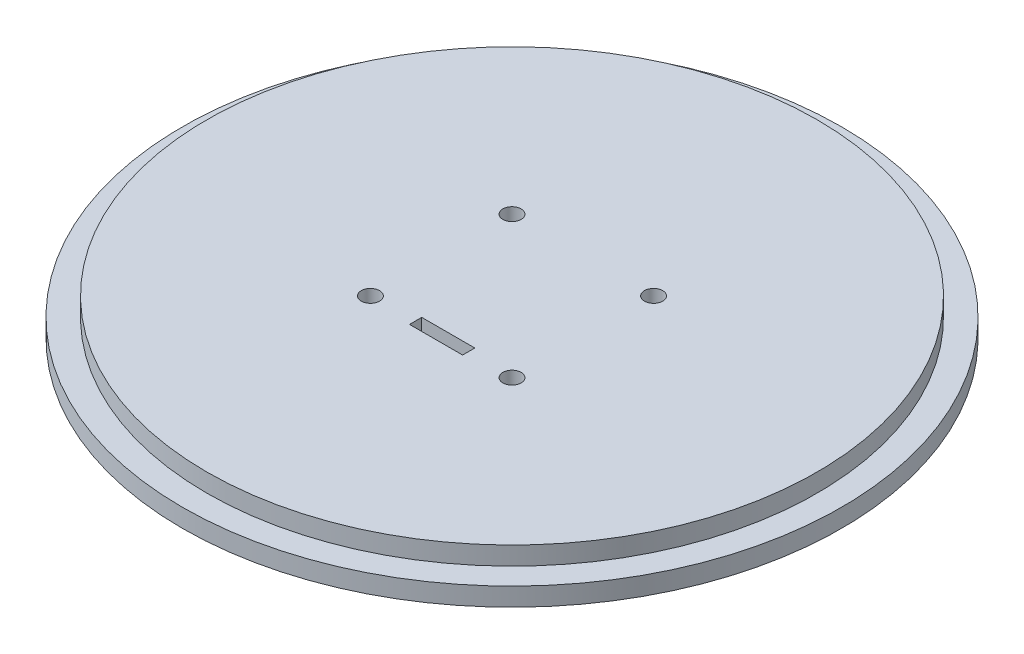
ISO-10303-21;
HEADER;
FILE_DESCRIPTION(('STEP AP214'),'2;1');
FILE_NAME('part.step','',(''),(''),'','','');
FILE_SCHEMA(('AUTOMOTIVE_DESIGN { 1 0 10303 214 1 1 1 1 }'));
ENDSEC;
DATA;
#1=APPLICATION_CONTEXT('core data for automotive mechanical design processes');
#2=APPLICATION_PROTOCOL_DEFINITION('international standard','automotive_design',2000,#1);
#3=PRODUCT_CONTEXT('',#1,'mechanical');
#4=PRODUCT('Part','Part','',(#3));
#5=PRODUCT_RELATED_PRODUCT_CATEGORY('part','',(#4));
#6=PRODUCT_DEFINITION_FORMATION('','',#4);
#7=PRODUCT_DEFINITION_CONTEXT('part definition',#1,'design');
#8=PRODUCT_DEFINITION('design','',#6,#7);
#9=PRODUCT_DEFINITION_SHAPE('','',#8);
#10=(LENGTH_UNIT() NAMED_UNIT(*) SI_UNIT(.MILLI.,.METRE.));
#11=(NAMED_UNIT(*) PLANE_ANGLE_UNIT() SI_UNIT($,.RADIAN.));
#12=(NAMED_UNIT(*) SI_UNIT($,.STERADIAN.) SOLID_ANGLE_UNIT());
#13=UNCERTAINTY_MEASURE_WITH_UNIT(LENGTH_MEASURE(1.E-05),#10,'distance_accuracy_value','');
#14=(GEOMETRIC_REPRESENTATION_CONTEXT(3) GLOBAL_UNCERTAINTY_ASSIGNED_CONTEXT((#13)) GLOBAL_UNIT_ASSIGNED_CONTEXT((#10,
#11,#12)) REPRESENTATION_CONTEXT('',''));
#15=CARTESIAN_POINT('',(0.,0.,0.));
#16=DIRECTION('',(0.,0.,1.));
#17=DIRECTION('',(1.,0.,0.));
#18=AXIS2_PLACEMENT_3D('',#15,#16,#17);
#19=CARTESIAN_POINT('',(-11.6,6.,-11.6));
#20=DIRECTION('',(0.,-1.,0.));
#21=DIRECTION('',(0.,0.,-1.));
#22=AXIS2_PLACEMENT_3D('',#19,#20,#21);
#23=CYLINDRICAL_SURFACE('',#22,1.5);
#24=CARTESIAN_POINT('',(-11.6,6.,-11.6));
#25=DIRECTION('',(0.,-1.,0.));
#26=DIRECTION('',(0.,0.,-1.));
#27=AXIS2_PLACEMENT_3D('',#24,#25,#26);
#28=CIRCLE('',#27,1.5);
#29=CARTESIAN_POINT('',(-11.6,6.,-13.1));
#30=VERTEX_POINT('',#29);
#31=EDGE_CURVE('E143',#30,#30,#28,.T.);
#32=ORIENTED_EDGE('',*,*,#31,.F.);
#33=EDGE_LOOP('',(#32));
#34=FACE_BOUND('',#33,.T.);
#35=CARTESIAN_POINT('',(-11.6,3.,-11.6));
#36=DIRECTION('',(0.,-1.,0.));
#37=DIRECTION('',(0.,0.,-1.));
#38=AXIS2_PLACEMENT_3D('',#35,#36,#37);
#39=CIRCLE('',#38,1.5);
#40=CARTESIAN_POINT('',(-11.6,3.,-13.1));
#41=VERTEX_POINT('',#40);
#42=EDGE_CURVE('E238',#41,#41,#39,.T.);
#43=ORIENTED_EDGE('',*,*,#42,.T.);
#44=EDGE_LOOP('',(#43));
#45=FACE_BOUND('',#44,.T.);
#46=ADVANCED_FACE('F33',(#34,#45),#23,.F.);
#47=CARTESIAN_POINT('',(11.6,6.,-11.6));
#48=DIRECTION('',(0.,-1.,0.));
#49=DIRECTION('',(0.,0.,-1.));
#50=AXIS2_PLACEMENT_3D('',#47,#48,#49);
#51=CYLINDRICAL_SURFACE('',#50,1.5);
#52=CARTESIAN_POINT('',(11.6,6.,-11.6));
#53=DIRECTION('',(0.,-1.,0.));
#54=DIRECTION('',(0.,0.,-1.));
#55=AXIS2_PLACEMENT_3D('',#52,#53,#54);
#56=CIRCLE('',#55,1.5);
#57=CARTESIAN_POINT('',(11.6,6.,-13.1));
#58=VERTEX_POINT('',#57);
#59=EDGE_CURVE('E140',#58,#58,#56,.T.);
#60=ORIENTED_EDGE('',*,*,#59,.F.);
#61=EDGE_LOOP('',(#60));
#62=FACE_BOUND('',#61,.T.);
#63=CARTESIAN_POINT('',(11.6,3.,-11.6));
#64=DIRECTION('',(0.,-1.,0.));
#65=DIRECTION('',(0.,0.,-1.));
#66=AXIS2_PLACEMENT_3D('',#63,#64,#65);
#67=CIRCLE('',#66,1.5);
#68=CARTESIAN_POINT('',(11.6,3.,-13.1));
#69=VERTEX_POINT('',#68);
#70=EDGE_CURVE('E233',#69,#69,#67,.T.);
#71=ORIENTED_EDGE('',*,*,#70,.T.);
#72=EDGE_LOOP('',(#71));
#73=FACE_BOUND('',#72,.T.);
#74=ADVANCED_FACE('F170',(#62,#73),#51,.F.);
#75=CARTESIAN_POINT('',(11.6,6.,11.6));
#76=DIRECTION('',(0.,-1.,0.));
#77=DIRECTION('',(0.,0.,-1.));
#78=AXIS2_PLACEMENT_3D('',#75,#76,#77);
#79=CYLINDRICAL_SURFACE('',#78,1.5);
#80=CARTESIAN_POINT('',(11.6,6.,11.6));
#81=DIRECTION('',(0.,-1.,0.));
#82=DIRECTION('',(0.,0.,-1.));
#83=AXIS2_PLACEMENT_3D('',#80,#81,#82);
#84=CIRCLE('',#83,1.5);
#85=CARTESIAN_POINT('',(11.6,6.,10.1));
#86=VERTEX_POINT('',#85);
#87=EDGE_CURVE('E137',#86,#86,#84,.T.);
#88=ORIENTED_EDGE('',*,*,#87,.F.);
#89=EDGE_LOOP('',(#88));
#90=FACE_BOUND('',#89,.T.);
#91=CARTESIAN_POINT('',(11.6,3.,11.6));
#92=DIRECTION('',(0.,-1.,0.));
#93=DIRECTION('',(0.,0.,-1.));
#94=AXIS2_PLACEMENT_3D('',#91,#92,#93);
#95=CIRCLE('',#94,1.5);
#96=CARTESIAN_POINT('',(11.6,3.,10.1));
#97=VERTEX_POINT('',#96);
#98=EDGE_CURVE('E241',#97,#97,#95,.T.);
#99=ORIENTED_EDGE('',*,*,#98,.T.);
#100=EDGE_LOOP('',(#99));
#101=FACE_BOUND('',#100,.T.);
#102=ADVANCED_FACE('F176',(#90,#101),#79,.F.);
#103=CARTESIAN_POINT('',(-11.6,6.,11.6));
#104=DIRECTION('',(0.,-1.,0.));
#105=DIRECTION('',(0.,0.,-1.));
#106=AXIS2_PLACEMENT_3D('',#103,#104,#105);
#107=CYLINDRICAL_SURFACE('',#106,1.49999999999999);
#108=CARTESIAN_POINT('',(-11.6,6.,11.6));
#109=DIRECTION('',(0.,-1.,0.));
#110=DIRECTION('',(0.,0.,-1.));
#111=AXIS2_PLACEMENT_3D('',#108,#109,#110);
#112=CIRCLE('',#111,1.49999999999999);
#113=CARTESIAN_POINT('',(-11.6,6.,10.1));
#114=VERTEX_POINT('',#113);
#115=EDGE_CURVE('E134',#114,#114,#112,.T.);
#116=ORIENTED_EDGE('',*,*,#115,.F.);
#117=EDGE_LOOP('',(#116));
#118=FACE_BOUND('',#117,.T.);
#119=CARTESIAN_POINT('',(-11.6,3.,11.6));
#120=DIRECTION('',(0.,-1.,0.));
#121=DIRECTION('',(0.,0.,-1.));
#122=AXIS2_PLACEMENT_3D('',#119,#120,#121);
#123=CIRCLE('',#122,1.49999999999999);
#124=CARTESIAN_POINT('',(-11.6,3.,10.1));
#125=VERTEX_POINT('',#124);
#126=EDGE_CURVE('E212',#125,#125,#123,.T.);
#127=ORIENTED_EDGE('',*,*,#126,.T.);
#128=EDGE_LOOP('',(#127));
#129=FACE_BOUND('',#128,.T.);
#130=ADVANCED_FACE('F277',(#118,#129),#107,.F.);
#131=CARTESIAN_POINT('',(4.35,6.,10.4416150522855));
#132=DIRECTION('',(1.,0.,0.));
#133=DIRECTION('',(0.,0.,-1.));
#134=AXIS2_PLACEMENT_3D('',#131,#132,#133);
#135=PLANE('',#134);
#136=DIRECTION('',(0.,0.,1.));
#137=VECTOR('',#136,1.);
#138=CARTESIAN_POINT('',(4.35,3.,10.4416150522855));
#139=LINE('',#138,#137);
#140=CARTESIAN_POINT('',(4.35,3.,10.4416150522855));
#141=VERTEX_POINT('',#140);
#142=CARTESIAN_POINT('',(4.35,3.,12.4416150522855));
#143=VERTEX_POINT('',#142);
#144=EDGE_CURVE('E100',#141,#143,#139,.T.);
#145=ORIENTED_EDGE('',*,*,#144,.T.);
#146=DIRECTION('',(0.,-1.,0.));
#147=VECTOR('',#146,1.);
#148=CARTESIAN_POINT('',(4.35,6.,12.4416150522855));
#149=LINE('',#148,#147);
#150=CARTESIAN_POINT('',(4.35,6.,12.4416150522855));
#151=VERTEX_POINT('',#150);
#152=EDGE_CURVE('E119',#151,#143,#149,.T.);
#153=ORIENTED_EDGE('',*,*,#152,.F.);
#154=DIRECTION('',(0.,0.,1.));
#155=VECTOR('',#154,1.);
#156=CARTESIAN_POINT('',(4.35,6.,10.4416150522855));
#157=LINE('',#156,#155);
#158=CARTESIAN_POINT('',(4.35,6.,10.4416150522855));
#159=VERTEX_POINT('',#158);
#160=EDGE_CURVE('E131',#159,#151,#157,.T.);
#161=ORIENTED_EDGE('',*,*,#160,.F.);
#162=DIRECTION('',(0.,-1.,0.));
#163=VECTOR('',#162,1.);
#164=CARTESIAN_POINT('',(4.35,6.,10.4416150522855));
#165=LINE('',#164,#163);
#166=EDGE_CURVE('E117',#159,#141,#165,.T.);
#167=ORIENTED_EDGE('',*,*,#166,.T.);
#168=EDGE_LOOP('',(#145,#153,#161,#167));
#169=FACE_BOUND('',#168,.T.);
#170=ADVANCED_FACE('F231',(#169),#135,.F.);
#171=CARTESIAN_POINT('',(4.35,6.,10.4416150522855));
#172=DIRECTION('',(0.,0.,1.));
#173=DIRECTION('',(1.,0.,0.));
#174=AXIS2_PLACEMENT_3D('',#171,#172,#173);
#175=PLANE('',#174);
#176=DIRECTION('',(0.,-1.,0.));
#177=VECTOR('',#176,1.);
#178=CARTESIAN_POINT('',(-4.35,6.,10.4416150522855));
#179=LINE('',#178,#177);
#180=CARTESIAN_POINT('',(-4.35,6.,10.4416150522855));
#181=VERTEX_POINT('',#180);
#182=CARTESIAN_POINT('',(-4.35,3.,10.4416150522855));
#183=VERTEX_POINT('',#182);
#184=EDGE_CURVE('E110',#181,#183,#179,.T.);
#185=ORIENTED_EDGE('',*,*,#184,.T.);
#186=DIRECTION('',(1.,0.,0.));
#187=VECTOR('',#186,1.);
#188=CARTESIAN_POINT('',(4.35,3.,10.4416150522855));
#189=LINE('',#188,#187);
#190=EDGE_CURVE('E96',#183,#141,#189,.T.);
#191=ORIENTED_EDGE('',*,*,#190,.T.);
#192=ORIENTED_EDGE('',*,*,#166,.F.);
#193=DIRECTION('',(-1.,0.,0.));
#194=VECTOR('',#193,1.);
#195=CARTESIAN_POINT('',(4.35,6.,10.4416150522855));
#196=LINE('',#195,#194);
#197=EDGE_CURVE('E116',#159,#181,#196,.T.);
#198=ORIENTED_EDGE('',*,*,#197,.T.);
#199=EDGE_LOOP('',(#185,#191,#192,#198));
#200=FACE_BOUND('',#199,.T.);
#201=ADVANCED_FACE('F114',(#200),#175,.T.);
#202=CARTESIAN_POINT('',(-4.35,6.,10.4416150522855));
#203=DIRECTION('',(1.,0.,0.));
#204=DIRECTION('',(0.,0.,-1.));
#205=AXIS2_PLACEMENT_3D('',#202,#203,#204);
#206=PLANE('',#205);
#207=DIRECTION('',(0.,-1.,0.));
#208=VECTOR('',#207,1.);
#209=CARTESIAN_POINT('',(-4.35,6.,12.4416150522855));
#210=LINE('',#209,#208);
#211=CARTESIAN_POINT('',(-4.35,6.,12.4416150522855));
#212=VERTEX_POINT('',#211);
#213=CARTESIAN_POINT('',(-4.35,3.,12.4416150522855));
#214=VERTEX_POINT('',#213);
#215=EDGE_CURVE('E112',#212,#214,#210,.T.);
#216=ORIENTED_EDGE('',*,*,#215,.T.);
#217=DIRECTION('',(0.,0.,-1.));
#218=VECTOR('',#217,1.);
#219=CARTESIAN_POINT('',(-4.35,3.,10.4416150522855));
#220=LINE('',#219,#218);
#221=EDGE_CURVE('E56',#214,#183,#220,.T.);
#222=ORIENTED_EDGE('',*,*,#221,.T.);
#223=ORIENTED_EDGE('',*,*,#184,.F.);
#224=DIRECTION('',(0.,0.,1.));
#225=VECTOR('',#224,1.);
#226=CARTESIAN_POINT('',(-4.35,6.,10.4416150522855));
#227=LINE('',#226,#225);
#228=EDGE_CURVE('E126',#181,#212,#227,.T.);
#229=ORIENTED_EDGE('',*,*,#228,.T.);
#230=EDGE_LOOP('',(#216,#222,#223,#229));
#231=FACE_BOUND('',#230,.T.);
#232=ADVANCED_FACE('F108',(#231),#206,.T.);
#233=CARTESIAN_POINT('',(4.35,6.,12.4416150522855));
#234=DIRECTION('',(0.,0.,1.));
#235=DIRECTION('',(1.,0.,0.));
#236=AXIS2_PLACEMENT_3D('',#233,#234,#235);
#237=PLANE('',#236);
#238=DIRECTION('',(-1.,0.,0.));
#239=VECTOR('',#238,1.);
#240=CARTESIAN_POINT('',(4.35,3.,12.4416150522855));
#241=LINE('',#240,#239);
#242=EDGE_CURVE('E228',#143,#214,#241,.T.);
#243=ORIENTED_EDGE('',*,*,#242,.T.);
#244=ORIENTED_EDGE('',*,*,#215,.F.);
#245=DIRECTION('',(-1.,0.,0.));
#246=VECTOR('',#245,1.);
#247=CARTESIAN_POINT('',(4.35,6.,12.4416150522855));
#248=LINE('',#247,#246);
#249=EDGE_CURVE('E128',#151,#212,#248,.T.);
#250=ORIENTED_EDGE('',*,*,#249,.F.);
#251=ORIENTED_EDGE('',*,*,#152,.T.);
#252=EDGE_LOOP('',(#243,#244,#250,#251));
#253=FACE_BOUND('',#252,.T.);
#254=ADVANCED_FACE('F157',(#253),#237,.F.);
#255=CARTESIAN_POINT('',(0.,3.,0.));
#256=DIRECTION('',(0.,1.,0.));
#257=DIRECTION('',(0.,0.,1.));
#258=AXIS2_PLACEMENT_3D('',#255,#256,#257);
#259=PLANE('',#258);
#260=CARTESIAN_POINT('',(0.,3.,0.));
#261=DIRECTION('',(0.,1.,0.));
#262=DIRECTION('',(0.,0.,1.));
#263=AXIS2_PLACEMENT_3D('',#260,#261,#262);
#264=CIRCLE('',#263,54.);
#265=CARTESIAN_POINT('',(0.,3.,54.));
#266=VERTEX_POINT('',#265);
#267=EDGE_CURVE('E11',#266,#266,#264,.T.);
#268=ORIENTED_EDGE('',*,*,#267,.T.);
#269=EDGE_LOOP('',(#268));
#270=FACE_BOUND('',#269,.T.);
#271=CARTESIAN_POINT('',(0.,3.,0.));
#272=DIRECTION('',(0.,1.,0.));
#273=DIRECTION('',(0.,0.,1.));
#274=AXIS2_PLACEMENT_3D('',#271,#272,#273);
#275=CIRCLE('',#274,50.);
#276=CARTESIAN_POINT('',(0.,3.,50.));
#277=VERTEX_POINT('',#276);
#278=EDGE_CURVE('E146',#277,#277,#275,.T.);
#279=ORIENTED_EDGE('',*,*,#278,.F.);
#280=EDGE_LOOP('',(#279));
#281=FACE_BOUND('',#280,.T.);
#282=ADVANCED_FACE('F155',(#270,#281),#259,.T.);
#283=CARTESIAN_POINT('',(0.,3.,0.));
#284=DIRECTION('',(0.,-1.,0.));
#285=DIRECTION('',(0.,0.,-1.));
#286=AXIS2_PLACEMENT_3D('',#283,#284,#285);
#287=CYLINDRICAL_SURFACE('',#286,54.);
#288=ORIENTED_EDGE('',*,*,#267,.F.);
#289=EDGE_LOOP('',(#288));
#290=FACE_BOUND('',#289,.T.);
#291=CARTESIAN_POINT('',(0.,0.,0.));
#292=DIRECTION('',(0.,1.,0.));
#293=DIRECTION('',(0.,0.,1.));
#294=AXIS2_PLACEMENT_3D('',#291,#292,#293);
#295=CIRCLE('',#294,54.);
#296=CARTESIAN_POINT('',(0.,0.,54.));
#297=VERTEX_POINT('',#296);
#298=EDGE_CURVE('E37',#297,#297,#295,.T.);
#299=ORIENTED_EDGE('',*,*,#298,.T.);
#300=EDGE_LOOP('',(#299));
#301=FACE_BOUND('',#300,.T.);
#302=ADVANCED_FACE('F35',(#290,#301),#287,.T.);
#303=CARTESIAN_POINT('',(0.,0.,0.));
#304=DIRECTION('',(0.,1.,0.));
#305=DIRECTION('',(0.,0.,1.));
#306=AXIS2_PLACEMENT_3D('',#303,#304,#305);
#307=PLANE('',#306);
#308=DIRECTION('',(1.,0.,0.));
#309=VECTOR('',#308,1.);
#310=CARTESIAN_POINT('',(14.15,0.,-14.15));
#311=LINE('',#310,#309);
#312=CARTESIAN_POINT('',(-14.15,0.,-14.15));
#313=VERTEX_POINT('',#312);
#314=CARTESIAN_POINT('',(14.15,0.,-14.15));
#315=VERTEX_POINT('',#314);
#316=EDGE_CURVE('E201',#313,#315,#311,.T.);
#317=ORIENTED_EDGE('',*,*,#316,.F.);
#318=DIRECTION('',(0.,0.,-1.));
#319=VECTOR('',#318,1.);
#320=CARTESIAN_POINT('',(-14.15,0.,-14.15));
#321=LINE('',#320,#319);
#322=CARTESIAN_POINT('',(-14.15,0.,14.15));
#323=VERTEX_POINT('',#322);
#324=EDGE_CURVE('E48',#323,#313,#321,.T.);
#325=ORIENTED_EDGE('',*,*,#324,.F.);
#326=DIRECTION('',(-1.,0.,0.));
#327=VECTOR('',#326,1.);
#328=CARTESIAN_POINT('',(14.15,0.,14.15));
#329=LINE('',#328,#327);
#330=CARTESIAN_POINT('',(14.15,0.,14.15));
#331=VERTEX_POINT('',#330);
#332=EDGE_CURVE('E210',#331,#323,#329,.T.);
#333=ORIENTED_EDGE('',*,*,#332,.F.);
#334=DIRECTION('',(0.,0.,1.));
#335=VECTOR('',#334,1.);
#336=CARTESIAN_POINT('',(14.15,0.,-14.15));
#337=LINE('',#336,#335);
#338=EDGE_CURVE('E207',#315,#331,#337,.T.);
#339=ORIENTED_EDGE('',*,*,#338,.F.);
#340=EDGE_LOOP('',(#317,#325,#333,#339));
#341=FACE_BOUND('',#340,.T.);
#342=ORIENTED_EDGE('',*,*,#298,.F.);
#343=EDGE_LOOP('',(#342));
#344=FACE_BOUND('',#343,.T.);
#345=ADVANCED_FACE('F164',(#341,#344),#307,.F.);
#346=CARTESIAN_POINT('',(0.,6.,0.));
#347=DIRECTION('',(0.,-1.,0.));
#348=DIRECTION('',(0.,0.,-1.));
#349=AXIS2_PLACEMENT_3D('',#346,#347,#348);
#350=CYLINDRICAL_SURFACE('',#349,50.);
#351=CARTESIAN_POINT('',(0.,6.,0.));
#352=DIRECTION('',(0.,1.,0.));
#353=DIRECTION('',(0.,0.,1.));
#354=AXIS2_PLACEMENT_3D('',#351,#352,#353);
#355=CIRCLE('',#354,50.);
#356=CARTESIAN_POINT('',(0.,6.,50.));
#357=VERTEX_POINT('',#356);
#358=EDGE_CURVE('E147',#357,#357,#355,.T.);
#359=ORIENTED_EDGE('',*,*,#358,.F.);
#360=EDGE_LOOP('',(#359));
#361=FACE_BOUND('',#360,.T.);
#362=ORIENTED_EDGE('',*,*,#278,.T.);
#363=EDGE_LOOP('',(#362));
#364=FACE_BOUND('',#363,.T.);
#365=ADVANCED_FACE('F153',(#361,#364),#350,.T.);
#366=CARTESIAN_POINT('',(0.,6.,0.));
#367=DIRECTION('',(0.,1.,0.));
#368=DIRECTION('',(0.,0.,1.));
#369=AXIS2_PLACEMENT_3D('',#366,#367,#368);
#370=PLANE('',#369);
#371=ORIENTED_EDGE('',*,*,#160,.T.);
#372=ORIENTED_EDGE('',*,*,#249,.T.);
#373=ORIENTED_EDGE('',*,*,#228,.F.);
#374=ORIENTED_EDGE('',*,*,#197,.F.);
#375=EDGE_LOOP('',(#371,#372,#373,#374));
#376=FACE_BOUND('',#375,.T.);
#377=ORIENTED_EDGE('',*,*,#115,.T.);
#378=EDGE_LOOP('',(#377));
#379=FACE_BOUND('',#378,.T.);
#380=ORIENTED_EDGE('',*,*,#87,.T.);
#381=EDGE_LOOP('',(#380));
#382=FACE_BOUND('',#381,.T.);
#383=ORIENTED_EDGE('',*,*,#59,.T.);
#384=EDGE_LOOP('',(#383));
#385=FACE_BOUND('',#384,.T.);
#386=ORIENTED_EDGE('',*,*,#31,.T.);
#387=EDGE_LOOP('',(#386));
#388=FACE_BOUND('',#387,.T.);
#389=ORIENTED_EDGE('',*,*,#358,.T.);
#390=EDGE_LOOP('',(#389));
#391=FACE_BOUND('',#390,.T.);
#392=ADVANCED_FACE('F183',(#376,#379,#382,#385,#388,#391),#370,.T.);
#393=CARTESIAN_POINT('',(-14.15,3.,-14.15));
#394=DIRECTION('',(-1.,0.,0.));
#395=DIRECTION('',(0.,0.,1.));
#396=AXIS2_PLACEMENT_3D('',#393,#394,#395);
#397=PLANE('',#396);
#398=ORIENTED_EDGE('',*,*,#324,.T.);
#399=DIRECTION('',(0.,-1.,0.));
#400=VECTOR('',#399,1.);
#401=CARTESIAN_POINT('',(-14.15,3.,-14.15));
#402=LINE('',#401,#400);
#403=CARTESIAN_POINT('',(-14.15,3.,-14.15));
#404=VERTEX_POINT('',#403);
#405=EDGE_CURVE('E224',#404,#313,#402,.T.);
#406=ORIENTED_EDGE('',*,*,#405,.F.);
#407=DIRECTION('',(0.,0.,-1.));
#408=VECTOR('',#407,1.);
#409=CARTESIAN_POINT('',(-14.15,3.,-14.15));
#410=LINE('',#409,#408);
#411=CARTESIAN_POINT('',(-14.15,3.,14.15));
#412=VERTEX_POINT('',#411);
#413=EDGE_CURVE('E218',#412,#404,#410,.T.);
#414=ORIENTED_EDGE('',*,*,#413,.F.);
#415=DIRECTION('',(0.,-1.,0.));
#416=VECTOR('',#415,1.);
#417=CARTESIAN_POINT('',(-14.15,3.,14.15));
#418=LINE('',#417,#416);
#419=EDGE_CURVE('E121',#412,#323,#418,.T.);
#420=ORIENTED_EDGE('',*,*,#419,.T.);
#421=EDGE_LOOP('',(#398,#406,#414,#420));
#422=FACE_BOUND('',#421,.T.);
#423=ADVANCED_FACE('F185',(#422),#397,.F.);
#424=CARTESIAN_POINT('',(14.15,3.,14.15));
#425=DIRECTION('',(0.,0.,1.));
#426=DIRECTION('',(1.,0.,0.));
#427=AXIS2_PLACEMENT_3D('',#424,#425,#426);
#428=PLANE('',#427);
#429=ORIENTED_EDGE('',*,*,#332,.T.);
#430=ORIENTED_EDGE('',*,*,#419,.F.);
#431=DIRECTION('',(-1.,0.,0.));
#432=VECTOR('',#431,1.);
#433=CARTESIAN_POINT('',(14.15,3.,14.15));
#434=LINE('',#433,#432);
#435=CARTESIAN_POINT('',(14.15,3.,14.15));
#436=VERTEX_POINT('',#435);
#437=EDGE_CURVE('E225',#436,#412,#434,.T.);
#438=ORIENTED_EDGE('',*,*,#437,.F.);
#439=DIRECTION('',(0.,-1.,0.));
#440=VECTOR('',#439,1.);
#441=CARTESIAN_POINT('',(14.15,3.,14.15));
#442=LINE('',#441,#440);
#443=EDGE_CURVE('E220',#436,#331,#442,.T.);
#444=ORIENTED_EDGE('',*,*,#443,.T.);
#445=EDGE_LOOP('',(#429,#430,#438,#444));
#446=FACE_BOUND('',#445,.T.);
#447=ADVANCED_FACE('F259',(#446),#428,.F.);
#448=CARTESIAN_POINT('',(14.15,3.,-14.15));
#449=DIRECTION('',(1.,0.,0.));
#450=DIRECTION('',(0.,0.,-1.));
#451=AXIS2_PLACEMENT_3D('',#448,#449,#450);
#452=PLANE('',#451);
#453=ORIENTED_EDGE('',*,*,#338,.T.);
#454=ORIENTED_EDGE('',*,*,#443,.F.);
#455=DIRECTION('',(0.,0.,1.));
#456=VECTOR('',#455,1.);
#457=CARTESIAN_POINT('',(14.15,3.,-14.15));
#458=LINE('',#457,#456);
#459=CARTESIAN_POINT('',(14.15,3.,-14.15));
#460=VERTEX_POINT('',#459);
#461=EDGE_CURVE('E251',#460,#436,#458,.T.);
#462=ORIENTED_EDGE('',*,*,#461,.F.);
#463=DIRECTION('',(0.,-1.,0.));
#464=VECTOR('',#463,1.);
#465=CARTESIAN_POINT('',(14.15,3.,-14.15));
#466=LINE('',#465,#464);
#467=EDGE_CURVE('E222',#460,#315,#466,.T.);
#468=ORIENTED_EDGE('',*,*,#467,.T.);
#469=EDGE_LOOP('',(#453,#454,#462,#468));
#470=FACE_BOUND('',#469,.T.);
#471=ADVANCED_FACE('F263',(#470),#452,.F.);
#472=CARTESIAN_POINT('',(14.15,3.,-14.15));
#473=DIRECTION('',(0.,0.,-1.));
#474=DIRECTION('',(-1.,0.,0.));
#475=AXIS2_PLACEMENT_3D('',#472,#473,#474);
#476=PLANE('',#475);
#477=ORIENTED_EDGE('',*,*,#316,.T.);
#478=ORIENTED_EDGE('',*,*,#467,.F.);
#479=DIRECTION('',(1.,0.,0.));
#480=VECTOR('',#479,1.);
#481=CARTESIAN_POINT('',(14.15,3.,-14.15));
#482=LINE('',#481,#480);
#483=EDGE_CURVE('E248',#404,#460,#482,.T.);
#484=ORIENTED_EDGE('',*,*,#483,.F.);
#485=ORIENTED_EDGE('',*,*,#405,.T.);
#486=EDGE_LOOP('',(#477,#478,#484,#485));
#487=FACE_BOUND('',#486,.T.);
#488=ADVANCED_FACE('F261',(#487),#476,.F.);
#489=CARTESIAN_POINT('',(0.,3.,0.));
#490=DIRECTION('',(0.,-1.,0.));
#491=DIRECTION('',(0.,0.,-1.));
#492=AXIS2_PLACEMENT_3D('',#489,#490,#491);
#493=PLANE('',#492);
#494=ORIENTED_EDGE('',*,*,#242,.F.);
#495=ORIENTED_EDGE('',*,*,#144,.F.);
#496=ORIENTED_EDGE('',*,*,#190,.F.);
#497=ORIENTED_EDGE('',*,*,#221,.F.);
#498=EDGE_LOOP('',(#494,#495,#496,#497));
#499=FACE_BOUND('',#498,.T.);
#500=ORIENTED_EDGE('',*,*,#70,.F.);
#501=EDGE_LOOP('',(#500));
#502=FACE_BOUND('',#501,.T.);
#503=ORIENTED_EDGE('',*,*,#42,.F.);
#504=EDGE_LOOP('',(#503));
#505=FACE_BOUND('',#504,.T.);
#506=ORIENTED_EDGE('',*,*,#98,.F.);
#507=EDGE_LOOP('',(#506));
#508=FACE_BOUND('',#507,.T.);
#509=ORIENTED_EDGE('',*,*,#126,.F.);
#510=EDGE_LOOP('',(#509));
#511=FACE_BOUND('',#510,.T.);
#512=ORIENTED_EDGE('',*,*,#413,.T.);
#513=ORIENTED_EDGE('',*,*,#483,.T.);
#514=ORIENTED_EDGE('',*,*,#461,.T.);
#515=ORIENTED_EDGE('',*,*,#437,.T.);
#516=EDGE_LOOP('',(#512,#513,#514,#515));
#517=FACE_BOUND('',#516,.T.);
#518=ADVANCED_FACE('F97',(#499,#502,#505,#508,#511,#517),#493,.T.);
#519=CLOSED_SHELL('',(#46,#74,#102,#130,#170,#201,#232,#254,#282,#302,#345,#365,#392,#423,#447,
#471,#488,#518));
#520=MANIFOLD_SOLID_BREP('B2',#519);
#521=ADVANCED_BREP_SHAPE_REPRESENTATION('',(#18,#520),#14);
#522=SHAPE_DEFINITION_REPRESENTATION(#9,#521);
ENDSEC;
END-ISO-10303-21;
